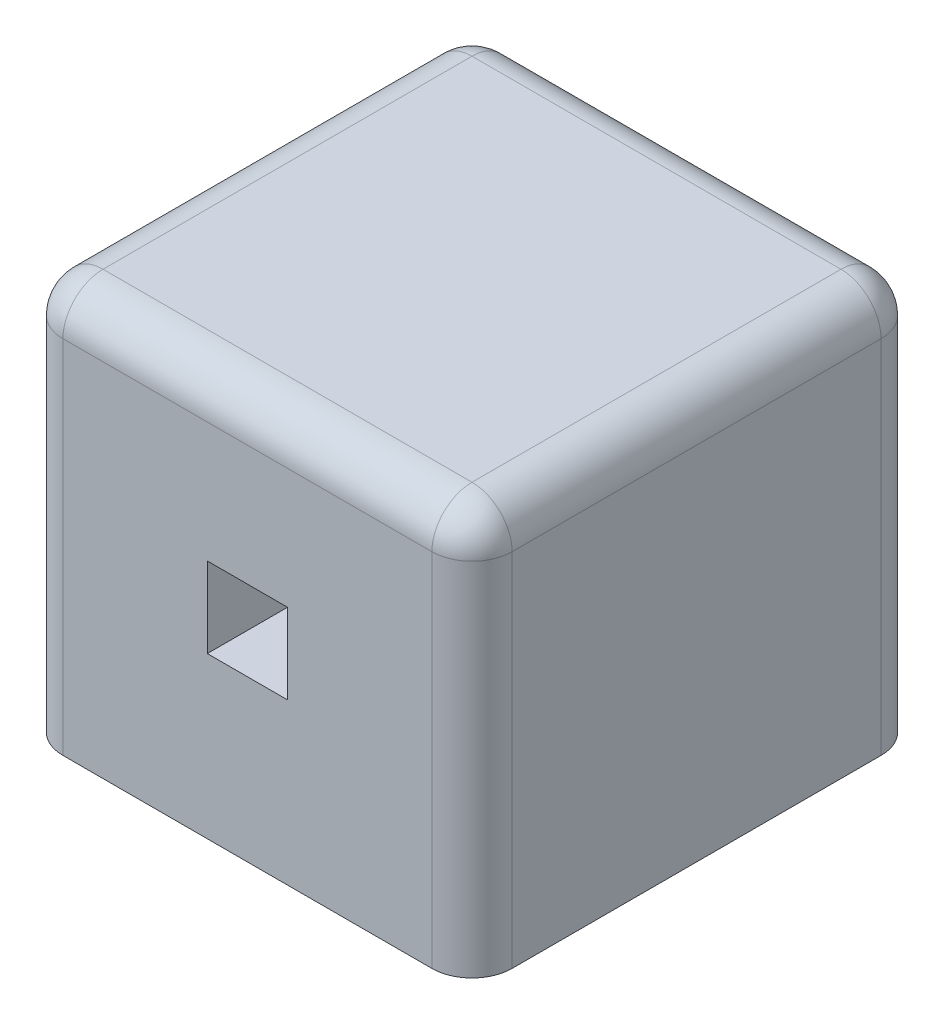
from build123d import *

# Parameters (mm, degrees)
SKETCH1_W           = 80
SKETCH1_H           = 71.428571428
SKETCH1_W_2         = 14.285714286
SKETCH1_H_2         = 14.285714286
BOSS_EXTRUDE1_DEPTH = 80
FILLET2_R           = 7.142857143
SKETCH3_R           = 5
BOSS_EXTRUDE6_DEPTH = 6


with BuildPart() as part:
    # Sketch1 → Boss-Extrude1 (new body)
    with BuildSketch(Plane.XY):
        Rectangle(SKETCH1_W, SKETCH1_H)
        Rectangle(SKETCH1_W_2, SKETCH1_H_2, mode=Mode.SUBTRACT)
    extrude(amount=BOSS_EXTRUDE1_DEPTH)

    # Fillet2
    fillet2_edges = [part.edges().sort_by_distance(p)[0] for p in [
        (40, 0, 80),
        (0, 35.714285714, 80),
        (-40, 0, 80),
        (0, 35.714285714, 0),
        (40, 0, 0),
        (-40, 0, 0),
        (-40, 35.714285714, 40),
        (40, 35.714285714, 40),
    ]]
    fillet(fillet2_edges, radius=FILLET2_R)

    # Sketch3 → Boss-Extrude6 (add)
    with BuildSketch(Plane.XZ.offset(35.714285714)):
        with Locations(Location((0, 40, 0), (0, 0, 90))):
            Circle(SKETCH3_R)
    extrude(amount=BOSS_EXTRUDE6_DEPTH)


solid = part.part
